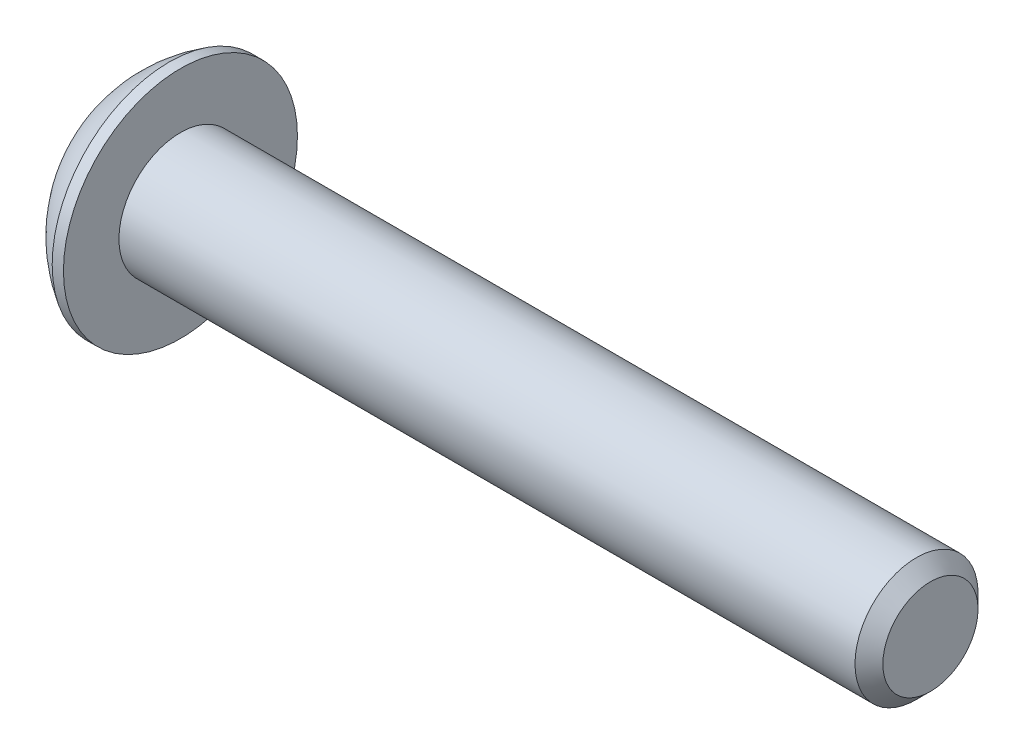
from build123d import *

# Parameters (mm, degrees)
HEX_2_DEPTH = 1.3208


with BuildPart() as part:
    # BodySke → BaseBody (revolve)
    with BuildSketch(Plane.XY, mode=Mode.PRIVATE) as basebody_sk:
        with BuildLine():
            Line((27.6098, 0), (27.6098, 1.61036))
            Line((27.6098, 1.61036), (27.13736, 2.0828))
            Line((27.13736, 2.0828), (2.2098, 2.0828))
            Line((2.2098, 2.0828), (2.2098, 3.9624))
            Line((2.2098, 3.9624), (1.8288, 3.9624))
            ThreePointArc((1.8288, 3.9624), (0.765445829, 3.109296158), (0, 1.9812))
            Line((0, 1.9812), (0, 0))
            Line((0, 0), (27.6098, 0))
        make_face()
    revolve(basebody_sk.sketch.rotate(Axis((0, 0, 0), (1, 0, 0)), 90), axis=Axis((0, 0, 0), (1, 0, 0)))

    # Sketch2 → PreBroach (revolve, cut)
    with BuildSketch(Plane.XY, mode=Mode.PRIVATE) as prebroach_sk:
        Polygon((0, 1.1938), (1.3208, 1.1938), (2.010040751, 0), (0, 0), align=None)
    revolve(prebroach_sk.sketch.rotate(Axis((0, 0, 0), (1, 0, 0)), 90), axis=Axis((0, 0, 0), (1, 0, 0)), mode=Mode.SUBTRACT)

    # Sketch3 → Hex 2 (cut)
    with BuildSketch(Plane(origin=(0, 0, 0), x_dir=(0, 0, -1), z_dir=(1, 0, 0))):
        Polygon((-1.1938, -0.689240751), (-1.1938, 0.689240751), (0, 1.378481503), (1.1938, 0.689240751), (1.1938, -0.689240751), (0, -1.378481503), align=None)
    extrude(amount=HEX_2_DEPTH, mode=Mode.SUBTRACT)


solid = part.part
